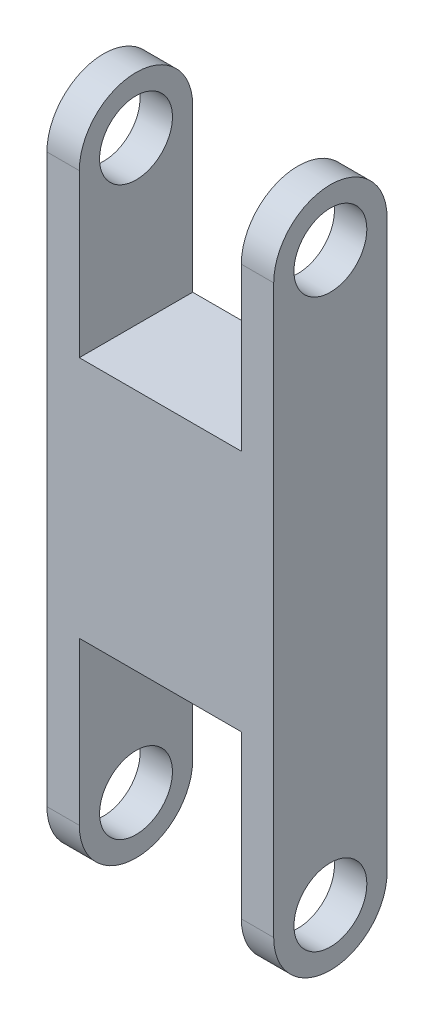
ISO-10303-21;
HEADER;
FILE_DESCRIPTION(('STEP AP214'),'2;1');
FILE_NAME('part.step','',(''),(''),'','','');
FILE_SCHEMA(('AUTOMOTIVE_DESIGN { 1 0 10303 214 1 1 1 1 }'));
ENDSEC;
DATA;
#1=APPLICATION_CONTEXT('core data for automotive mechanical design processes');
#2=APPLICATION_PROTOCOL_DEFINITION('international standard','automotive_design',2000,#1);
#3=PRODUCT_CONTEXT('',#1,'mechanical');
#4=PRODUCT('Part','Part','',(#3));
#5=PRODUCT_RELATED_PRODUCT_CATEGORY('part','',(#4));
#6=PRODUCT_DEFINITION_FORMATION('','',#4);
#7=PRODUCT_DEFINITION_CONTEXT('part definition',#1,'design');
#8=PRODUCT_DEFINITION('design','',#6,#7);
#9=PRODUCT_DEFINITION_SHAPE('','',#8);
#10=(LENGTH_UNIT() NAMED_UNIT(*) SI_UNIT(.MILLI.,.METRE.));
#11=(NAMED_UNIT(*) PLANE_ANGLE_UNIT() SI_UNIT($,.RADIAN.));
#12=(NAMED_UNIT(*) SI_UNIT($,.STERADIAN.) SOLID_ANGLE_UNIT());
#13=UNCERTAINTY_MEASURE_WITH_UNIT(LENGTH_MEASURE(1.E-05),#10,'distance_accuracy_value','');
#14=(GEOMETRIC_REPRESENTATION_CONTEXT(3) GLOBAL_UNCERTAINTY_ASSIGNED_CONTEXT((#13)) GLOBAL_UNIT_ASSIGNED_CONTEXT((#10,
#11,#12)) REPRESENTATION_CONTEXT('',''));
#15=CARTESIAN_POINT('',(0.,0.,0.));
#16=DIRECTION('',(0.,0.,1.));
#17=DIRECTION('',(1.,0.,0.));
#18=AXIS2_PLACEMENT_3D('',#15,#16,#17);
#19=CARTESIAN_POINT('',(0.,-175.,-35.));
#20=DIRECTION('',(1.,0.,0.));
#21=DIRECTION('',(0.,0.,-1.));
#22=AXIS2_PLACEMENT_3D('',#19,#20,#21);
#23=PLANE('',#22);
#24=CARTESIAN_POINT('',(0.,175.,-35.));
#25=DIRECTION('',(1.,0.,0.));
#26=DIRECTION('',(0.,0.,-1.));
#27=AXIS2_PLACEMENT_3D('',#24,#25,#26);
#28=CIRCLE('',#27,22.5);
#29=CARTESIAN_POINT('',(0.,175.,-57.5));
#30=VERTEX_POINT('',#29);
#31=EDGE_CURVE('E202',#30,#30,#28,.T.);
#32=ORIENTED_EDGE('',*,*,#31,.T.);
#33=EDGE_LOOP('',(#32));
#34=FACE_BOUND('',#33,.T.);
#35=DIRECTION('',(0.,0.,-1.));
#36=VECTOR('',#35,1.);
#37=CARTESIAN_POINT('',(0.,75.,-70.));
#38=LINE('',#37,#36);
#39=CARTESIAN_POINT('',(0.,75.,0.));
#40=VERTEX_POINT('',#39);
#41=CARTESIAN_POINT('',(0.,75.,-70.));
#42=VERTEX_POINT('',#41);
#43=EDGE_CURVE('E178',#40,#42,#38,.T.);
#44=ORIENTED_EDGE('',*,*,#43,.F.);
#45=DIRECTION('',(0.,-1.,0.));
#46=VECTOR('',#45,1.);
#47=CARTESIAN_POINT('',(0.,175.,0.));
#48=LINE('',#47,#46);
#49=CARTESIAN_POINT('',(0.,175.,0.));
#50=VERTEX_POINT('',#49);
#51=EDGE_CURVE('E219',#50,#40,#48,.T.);
#52=ORIENTED_EDGE('',*,*,#51,.F.);
#53=CARTESIAN_POINT('',(0.,175.,-35.));
#54=DIRECTION('',(1.,0.,0.));
#55=DIRECTION('',(0.,0.,-1.));
#56=AXIS2_PLACEMENT_3D('',#53,#54,#55);
#57=CIRCLE('',#56,35.);
#58=CARTESIAN_POINT('',(0.,175.,-70.));
#59=VERTEX_POINT('',#58);
#60=EDGE_CURVE('E235',#59,#50,#57,.T.);
#61=ORIENTED_EDGE('',*,*,#60,.F.);
#62=DIRECTION('',(0.,1.,0.));
#63=VECTOR('',#62,1.);
#64=CARTESIAN_POINT('',(0.,-175.,-70.));
#65=LINE('',#64,#63);
#66=EDGE_CURVE('E57',#42,#59,#65,.T.);
#67=ORIENTED_EDGE('',*,*,#66,.F.);
#68=EDGE_LOOP('',(#44,#52,#61,#67));
#69=FACE_BOUND('',#68,.T.);
#70=ADVANCED_FACE('F41',(#34,#69),#23,.F.);
#71=CARTESIAN_POINT('',(0.,-175.,-35.));
#72=DIRECTION('',(1.,0.,0.));
#73=DIRECTION('',(0.,0.,-1.));
#74=AXIS2_PLACEMENT_3D('',#71,#72,#73);
#75=CIRCLE('',#74,22.5);
#76=CARTESIAN_POINT('',(0.,-175.,-57.5));
#77=VERTEX_POINT('',#76);
#78=EDGE_CURVE('E197',#77,#77,#75,.T.);
#79=ORIENTED_EDGE('',*,*,#78,.T.);
#80=EDGE_LOOP('',(#79));
#81=FACE_BOUND('',#80,.T.);
#82=DIRECTION('',(0.,0.,1.));
#83=VECTOR('',#82,1.);
#84=CARTESIAN_POINT('',(0.,-75.,-70.));
#85=LINE('',#84,#83);
#86=CARTESIAN_POINT('',(0.,-75.,-70.));
#87=VERTEX_POINT('',#86);
#88=CARTESIAN_POINT('',(0.,-75.,0.));
#89=VERTEX_POINT('',#88);
#90=EDGE_CURVE('E65',#87,#89,#85,.T.);
#91=ORIENTED_EDGE('',*,*,#90,.F.);
#92=CARTESIAN_POINT('',(0.,-175.,-70.));
#93=VERTEX_POINT('',#92);
#94=EDGE_CURVE('E232',#93,#87,#65,.T.);
#95=ORIENTED_EDGE('',*,*,#94,.F.);
#96=CARTESIAN_POINT('',(0.,-175.,-35.));
#97=DIRECTION('',(1.,0.,0.));
#98=DIRECTION('',(0.,0.,-1.));
#99=AXIS2_PLACEMENT_3D('',#96,#97,#98);
#100=CIRCLE('',#99,35.);
#101=CARTESIAN_POINT('',(0.,-175.,0.));
#102=VERTEX_POINT('',#101);
#103=EDGE_CURVE('E210',#102,#93,#100,.T.);
#104=ORIENTED_EDGE('',*,*,#103,.F.);
#105=EDGE_CURVE('E238',#89,#102,#48,.T.);
#106=ORIENTED_EDGE('',*,*,#105,.F.);
#107=EDGE_LOOP('',(#91,#95,#104,#106));
#108=FACE_BOUND('',#107,.T.);
#109=ADVANCED_FACE('F326',(#81,#108),#23,.F.);
#110=CARTESIAN_POINT('',(20.,-175.,-35.));
#111=DIRECTION('',(1.,0.,0.));
#112=DIRECTION('',(0.,0.,-1.));
#113=AXIS2_PLACEMENT_3D('',#110,#111,#112);
#114=PLANE('',#113);
#115=CARTESIAN_POINT('',(20.,175.,-35.));
#116=DIRECTION('',(1.,0.,0.));
#117=DIRECTION('',(0.,0.,-1.));
#118=AXIS2_PLACEMENT_3D('',#115,#116,#117);
#119=CIRCLE('',#118,22.5);
#120=CARTESIAN_POINT('',(20.,175.,-57.5));
#121=VERTEX_POINT('',#120);
#122=EDGE_CURVE('E206',#121,#121,#119,.T.);
#123=ORIENTED_EDGE('',*,*,#122,.F.);
#124=EDGE_LOOP('',(#123));
#125=FACE_BOUND('',#124,.T.);
#126=CARTESIAN_POINT('',(20.,-175.,-35.));
#127=DIRECTION('',(1.,0.,0.));
#128=DIRECTION('',(0.,0.,-1.));
#129=AXIS2_PLACEMENT_3D('',#126,#127,#128);
#130=CIRCLE('',#129,35.);
#131=CARTESIAN_POINT('',(20.,-175.,0.));
#132=VERTEX_POINT('',#131);
#133=CARTESIAN_POINT('',(20.,-175.,-70.));
#134=VERTEX_POINT('',#133);
#135=EDGE_CURVE('E214',#132,#134,#130,.T.);
#136=ORIENTED_EDGE('',*,*,#135,.T.);
#137=DIRECTION('',(0.,1.,0.));
#138=VECTOR('',#137,1.);
#139=CARTESIAN_POINT('',(20.,-175.,-70.));
#140=LINE('',#139,#138);
#141=CARTESIAN_POINT('',(20.,175.,-70.));
#142=VERTEX_POINT('',#141);
#143=EDGE_CURVE('E218',#134,#142,#140,.T.);
#144=ORIENTED_EDGE('',*,*,#143,.T.);
#145=CARTESIAN_POINT('',(20.,175.,-35.));
#146=DIRECTION('',(1.,0.,0.));
#147=DIRECTION('',(0.,0.,-1.));
#148=AXIS2_PLACEMENT_3D('',#145,#146,#147);
#149=CIRCLE('',#148,35.);
#150=CARTESIAN_POINT('',(20.,175.,0.));
#151=VERTEX_POINT('',#150);
#152=EDGE_CURVE('E222',#142,#151,#149,.T.);
#153=ORIENTED_EDGE('',*,*,#152,.T.);
#154=DIRECTION('',(0.,-1.,0.));
#155=VECTOR('',#154,1.);
#156=CARTESIAN_POINT('',(20.,175.,0.));
#157=LINE('',#156,#155);
#158=EDGE_CURVE('E225',#151,#132,#157,.T.);
#159=ORIENTED_EDGE('',*,*,#158,.T.);
#160=EDGE_LOOP('',(#136,#144,#153,#159));
#161=FACE_BOUND('',#160,.T.);
#162=CARTESIAN_POINT('',(20.,-175.,-35.));
#163=DIRECTION('',(1.,0.,0.));
#164=DIRECTION('',(0.,0.,-1.));
#165=AXIS2_PLACEMENT_3D('',#162,#163,#164);
#166=CIRCLE('',#165,22.5);
#167=CARTESIAN_POINT('',(20.,-175.,-57.5));
#168=VERTEX_POINT('',#167);
#169=EDGE_CURVE('E198',#168,#168,#166,.T.);
#170=ORIENTED_EDGE('',*,*,#169,.F.);
#171=EDGE_LOOP('',(#170));
#172=FACE_BOUND('',#171,.T.);
#173=ADVANCED_FACE('F332',(#125,#161,#172),#114,.T.);
#174=CARTESIAN_POINT('',(20.,-175.,-35.));
#175=DIRECTION('',(-1.,0.,0.));
#176=DIRECTION('',(0.,0.,1.));
#177=AXIS2_PLACEMENT_3D('',#174,#175,#176);
#178=CYLINDRICAL_SURFACE('',#177,35.);
#179=ORIENTED_EDGE('',*,*,#103,.T.);
#180=DIRECTION('',(-1.,0.,0.));
#181=VECTOR('',#180,1.);
#182=CARTESIAN_POINT('',(20.,-175.,-70.));
#183=LINE('',#182,#181);
#184=EDGE_CURVE('E11',#134,#93,#183,.T.);
#185=ORIENTED_EDGE('',*,*,#184,.F.);
#186=ORIENTED_EDGE('',*,*,#135,.F.);
#187=DIRECTION('',(-1.,0.,0.));
#188=VECTOR('',#187,1.);
#189=CARTESIAN_POINT('',(20.,-175.,0.));
#190=LINE('',#189,#188);
#191=EDGE_CURVE('E228',#132,#102,#190,.T.);
#192=ORIENTED_EDGE('',*,*,#191,.T.);
#193=EDGE_LOOP('',(#179,#185,#186,#192));
#194=FACE_BOUND('',#193,.T.);
#195=ADVANCED_FACE('F43',(#194),#178,.T.);
#196=CARTESIAN_POINT('',(20.,-175.,-70.));
#197=DIRECTION('',(0.,0.,1.));
#198=DIRECTION('',(1.,0.,0.));
#199=AXIS2_PLACEMENT_3D('',#196,#197,#198);
#200=PLANE('',#199);
#201=ORIENTED_EDGE('',*,*,#94,.T.);
#202=DIRECTION('',(1.,0.,0.));
#203=VECTOR('',#202,1.);
#204=CARTESIAN_POINT('',(-215.529453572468,-75.,-70.));
#205=LINE('',#204,#203);
#206=CARTESIAN_POINT('',(-100.,-75.,-70.));
#207=VERTEX_POINT('',#206);
#208=EDGE_CURVE('E193',#207,#87,#205,.T.);
#209=ORIENTED_EDGE('',*,*,#208,.F.);
#210=DIRECTION('',(0.,-1.,0.));
#211=VECTOR('',#210,1.);
#212=CARTESIAN_POINT('',(-100.,-175.,-70.));
#213=LINE('',#212,#211);
#214=CARTESIAN_POINT('',(-100.,-175.,-70.));
#215=VERTEX_POINT('',#214);
#216=EDGE_CURVE('E279',#207,#215,#213,.T.);
#217=ORIENTED_EDGE('',*,*,#216,.T.);
#218=DIRECTION('',(1.,0.,0.));
#219=VECTOR('',#218,1.);
#220=CARTESIAN_POINT('',(-120.,-175.,-70.));
#221=LINE('',#220,#219);
#222=CARTESIAN_POINT('',(-120.,-175.,-70.));
#223=VERTEX_POINT('',#222);
#224=EDGE_CURVE('E282',#223,#215,#221,.T.);
#225=ORIENTED_EDGE('',*,*,#224,.F.);
#226=DIRECTION('',(0.,-1.,0.));
#227=VECTOR('',#226,1.);
#228=CARTESIAN_POINT('',(-120.,-175.,-70.));
#229=LINE('',#228,#227);
#230=CARTESIAN_POINT('',(-120.,175.,-70.));
#231=VERTEX_POINT('',#230);
#232=EDGE_CURVE('E151',#231,#223,#229,.T.);
#233=ORIENTED_EDGE('',*,*,#232,.F.);
#234=DIRECTION('',(1.,0.,0.));
#235=VECTOR('',#234,1.);
#236=CARTESIAN_POINT('',(-120.,175.,-70.));
#237=LINE('',#236,#235);
#238=CARTESIAN_POINT('',(-100.,175.,-70.));
#239=VERTEX_POINT('',#238);
#240=EDGE_CURVE('E169',#231,#239,#237,.T.);
#241=ORIENTED_EDGE('',*,*,#240,.T.);
#242=CARTESIAN_POINT('',(-100.,75.,-70.));
#243=VERTEX_POINT('',#242);
#244=EDGE_CURVE('E156',#239,#243,#213,.T.);
#245=ORIENTED_EDGE('',*,*,#244,.T.);
#246=DIRECTION('',(1.,0.,0.));
#247=VECTOR('',#246,1.);
#248=CARTESIAN_POINT('',(-215.529453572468,75.,-70.));
#249=LINE('',#248,#247);
#250=EDGE_CURVE('E182',#243,#42,#249,.T.);
#251=ORIENTED_EDGE('',*,*,#250,.T.);
#252=ORIENTED_EDGE('',*,*,#66,.T.);
#253=DIRECTION('',(-1.,0.,0.));
#254=VECTOR('',#253,1.);
#255=CARTESIAN_POINT('',(20.,175.,-70.));
#256=LINE('',#255,#254);
#257=EDGE_CURVE('E50',#142,#59,#256,.T.);
#258=ORIENTED_EDGE('',*,*,#257,.F.);
#259=ORIENTED_EDGE('',*,*,#143,.F.);
#260=ORIENTED_EDGE('',*,*,#184,.T.);
#261=EDGE_LOOP('',(#201,#209,#217,#225,#233,#241,#245,#251,#252,#258,#259,#260));
#262=FACE_BOUND('',#261,.T.);
#263=ADVANCED_FACE('F287',(#262),#200,.F.);
#264=CARTESIAN_POINT('',(20.,175.,-35.));
#265=DIRECTION('',(-1.,0.,0.));
#266=DIRECTION('',(0.,0.,1.));
#267=AXIS2_PLACEMENT_3D('',#264,#265,#266);
#268=CYLINDRICAL_SURFACE('',#267,35.);
#269=ORIENTED_EDGE('',*,*,#60,.T.);
#270=DIRECTION('',(-1.,0.,0.));
#271=VECTOR('',#270,1.);
#272=CARTESIAN_POINT('',(20.,175.,0.));
#273=LINE('',#272,#271);
#274=EDGE_CURVE('E244',#151,#50,#273,.T.);
#275=ORIENTED_EDGE('',*,*,#274,.F.);
#276=ORIENTED_EDGE('',*,*,#152,.F.);
#277=ORIENTED_EDGE('',*,*,#257,.T.);
#278=EDGE_LOOP('',(#269,#275,#276,#277));
#279=FACE_BOUND('',#278,.T.);
#280=ADVANCED_FACE('F252',(#279),#268,.T.);
#281=CARTESIAN_POINT('',(20.,175.,0.));
#282=DIRECTION('',(0.,0.,-1.));
#283=DIRECTION('',(0.,1.,0.));
#284=AXIS2_PLACEMENT_3D('',#281,#282,#283);
#285=PLANE('',#284);
#286=ORIENTED_EDGE('',*,*,#51,.T.);
#287=DIRECTION('',(1.,0.,0.));
#288=VECTOR('',#287,1.);
#289=CARTESIAN_POINT('',(-215.529453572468,75.,0.));
#290=LINE('',#289,#288);
#291=CARTESIAN_POINT('',(-100.,75.,0.));
#292=VERTEX_POINT('',#291);
#293=EDGE_CURVE('E185',#292,#40,#290,.T.);
#294=ORIENTED_EDGE('',*,*,#293,.F.);
#295=DIRECTION('',(0.,1.,0.));
#296=VECTOR('',#295,1.);
#297=CARTESIAN_POINT('',(-100.,175.,0.));
#298=LINE('',#297,#296);
#299=CARTESIAN_POINT('',(-100.,175.,0.));
#300=VERTEX_POINT('',#299);
#301=EDGE_CURVE('E265',#292,#300,#298,.T.);
#302=ORIENTED_EDGE('',*,*,#301,.T.);
#303=DIRECTION('',(1.,0.,0.));
#304=VECTOR('',#303,1.);
#305=CARTESIAN_POINT('',(-120.,175.,0.));
#306=LINE('',#305,#304);
#307=CARTESIAN_POINT('',(-120.,175.,0.));
#308=VERTEX_POINT('',#307);
#309=EDGE_CURVE('E140',#308,#300,#306,.T.);
#310=ORIENTED_EDGE('',*,*,#309,.F.);
#311=DIRECTION('',(0.,1.,0.));
#312=VECTOR('',#311,1.);
#313=CARTESIAN_POINT('',(-120.,175.,0.));
#314=LINE('',#313,#312);
#315=CARTESIAN_POINT('',(-120.,-175.,0.));
#316=VERTEX_POINT('',#315);
#317=EDGE_CURVE('E131',#316,#308,#314,.T.);
#318=ORIENTED_EDGE('',*,*,#317,.F.);
#319=DIRECTION('',(1.,0.,0.));
#320=VECTOR('',#319,1.);
#321=CARTESIAN_POINT('',(-120.,-175.,0.));
#322=LINE('',#321,#320);
#323=CARTESIAN_POINT('',(-100.,-175.,0.));
#324=VERTEX_POINT('',#323);
#325=EDGE_CURVE('E137',#316,#324,#322,.T.);
#326=ORIENTED_EDGE('',*,*,#325,.T.);
#327=CARTESIAN_POINT('',(-100.,-75.,0.));
#328=VERTEX_POINT('',#327);
#329=EDGE_CURVE('E269',#324,#328,#298,.T.);
#330=ORIENTED_EDGE('',*,*,#329,.T.);
#331=DIRECTION('',(1.,0.,0.));
#332=VECTOR('',#331,1.);
#333=CARTESIAN_POINT('',(-215.529453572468,-75.,0.));
#334=LINE('',#333,#332);
#335=EDGE_CURVE('E189',#328,#89,#334,.T.);
#336=ORIENTED_EDGE('',*,*,#335,.T.);
#337=ORIENTED_EDGE('',*,*,#105,.T.);
#338=ORIENTED_EDGE('',*,*,#191,.F.);
#339=ORIENTED_EDGE('',*,*,#158,.F.);
#340=ORIENTED_EDGE('',*,*,#274,.T.);
#341=EDGE_LOOP('',(#286,#294,#302,#310,#318,#326,#330,#336,#337,#338,#339,#340));
#342=FACE_BOUND('',#341,.T.);
#343=ADVANCED_FACE('F134',(#342),#285,.F.);
#344=CARTESIAN_POINT('',(20.,175.,-35.));
#345=DIRECTION('',(-1.,0.,0.));
#346=DIRECTION('',(0.,0.,1.));
#347=AXIS2_PLACEMENT_3D('',#344,#345,#346);
#348=CYLINDRICAL_SURFACE('',#347,22.5);
#349=ORIENTED_EDGE('',*,*,#122,.T.);
#350=EDGE_LOOP('',(#349));
#351=FACE_BOUND('',#350,.T.);
#352=ORIENTED_EDGE('',*,*,#31,.F.);
#353=EDGE_LOOP('',(#352));
#354=FACE_BOUND('',#353,.T.);
#355=ADVANCED_FACE('F339',(#351,#354),#348,.F.);
#356=CARTESIAN_POINT('',(20.,-175.,-35.));
#357=DIRECTION('',(-1.,0.,0.));
#358=DIRECTION('',(0.,0.,1.));
#359=AXIS2_PLACEMENT_3D('',#356,#357,#358);
#360=CYLINDRICAL_SURFACE('',#359,22.5);
#361=ORIENTED_EDGE('',*,*,#169,.T.);
#362=EDGE_LOOP('',(#361));
#363=FACE_BOUND('',#362,.T.);
#364=ORIENTED_EDGE('',*,*,#78,.F.);
#365=EDGE_LOOP('',(#364));
#366=FACE_BOUND('',#365,.T.);
#367=ADVANCED_FACE('F368',(#363,#366),#360,.F.);
#368=CARTESIAN_POINT('',(-215.529453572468,75.,-70.));
#369=DIRECTION('',(0.,-1.,0.));
#370=DIRECTION('',(0.,0.,-1.));
#371=AXIS2_PLACEMENT_3D('',#368,#369,#370);
#372=PLANE('',#371);
#373=ORIENTED_EDGE('',*,*,#250,.F.);
#374=DIRECTION('',(0.,0.,-1.));
#375=VECTOR('',#374,1.);
#376=CARTESIAN_POINT('',(-100.,75.,-70.));
#377=LINE('',#376,#375);
#378=EDGE_CURVE('E167',#292,#243,#377,.T.);
#379=ORIENTED_EDGE('',*,*,#378,.F.);
#380=ORIENTED_EDGE('',*,*,#293,.T.);
#381=ORIENTED_EDGE('',*,*,#43,.T.);
#382=EDGE_LOOP('',(#373,#379,#380,#381));
#383=FACE_BOUND('',#382,.T.);
#384=ADVANCED_FACE('F259',(#383),#372,.F.);
#385=CARTESIAN_POINT('',(-215.529453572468,-75.,-70.));
#386=DIRECTION('',(0.,1.,0.));
#387=DIRECTION('',(0.,0.,1.));
#388=AXIS2_PLACEMENT_3D('',#385,#386,#387);
#389=PLANE('',#388);
#390=ORIENTED_EDGE('',*,*,#335,.F.);
#391=DIRECTION('',(0.,0.,1.));
#392=VECTOR('',#391,1.);
#393=CARTESIAN_POINT('',(-100.,-75.,-70.));
#394=LINE('',#393,#392);
#395=EDGE_CURVE('E162',#207,#328,#394,.T.);
#396=ORIENTED_EDGE('',*,*,#395,.F.);
#397=ORIENTED_EDGE('',*,*,#208,.T.);
#398=ORIENTED_EDGE('',*,*,#90,.T.);
#399=EDGE_LOOP('',(#390,#396,#397,#398));
#400=FACE_BOUND('',#399,.T.);
#401=ADVANCED_FACE('F322',(#400),#389,.F.);
#402=CARTESIAN_POINT('',(-100.,-175.,-35.));
#403=DIRECTION('',(1.,0.,0.));
#404=DIRECTION('',(0.,0.,-1.));
#405=AXIS2_PLACEMENT_3D('',#402,#403,#404);
#406=PLANE('',#405);
#407=CARTESIAN_POINT('',(-100.,-175.,-35.));
#408=DIRECTION('',(-1.,0.,0.));
#409=DIRECTION('',(0.,0.,1.));
#410=AXIS2_PLACEMENT_3D('',#407,#408,#409);
#411=CIRCLE('',#410,22.5);
#412=CARTESIAN_POINT('',(-100.,-175.,-12.5));
#413=VERTEX_POINT('',#412);
#414=EDGE_CURVE('E302',#413,#413,#411,.T.);
#415=ORIENTED_EDGE('',*,*,#414,.T.);
#416=EDGE_LOOP('',(#415));
#417=FACE_BOUND('',#416,.T.);
#418=ORIENTED_EDGE('',*,*,#216,.F.);
#419=ORIENTED_EDGE('',*,*,#395,.T.);
#420=ORIENTED_EDGE('',*,*,#329,.F.);
#421=CARTESIAN_POINT('',(-100.,-175.,-35.));
#422=DIRECTION('',(-1.,0.,0.));
#423=DIRECTION('',(0.,0.,-1.));
#424=AXIS2_PLACEMENT_3D('',#421,#422,#423);
#425=CIRCLE('',#424,35.);
#426=EDGE_CURVE('E160',#215,#324,#425,.T.);
#427=ORIENTED_EDGE('',*,*,#426,.F.);
#428=EDGE_LOOP('',(#418,#419,#420,#427));
#429=FACE_BOUND('',#428,.T.);
#430=ADVANCED_FACE('F314',(#417,#429),#406,.T.);
#431=CARTESIAN_POINT('',(-120.,-175.,-35.));
#432=DIRECTION('',(1.,0.,0.));
#433=DIRECTION('',(0.,0.,-1.));
#434=AXIS2_PLACEMENT_3D('',#431,#432,#433);
#435=PLANE('',#434);
#436=CARTESIAN_POINT('',(-120.,-175.,-35.));
#437=DIRECTION('',(-1.,0.,0.));
#438=DIRECTION('',(0.,0.,-1.));
#439=AXIS2_PLACEMENT_3D('',#436,#437,#438);
#440=CIRCLE('',#439,35.);
#441=EDGE_CURVE('E145',#223,#316,#440,.T.);
#442=ORIENTED_EDGE('',*,*,#441,.T.);
#443=ORIENTED_EDGE('',*,*,#317,.T.);
#444=CARTESIAN_POINT('',(-120.,175.,-35.));
#445=DIRECTION('',(-1.,0.,0.));
#446=DIRECTION('',(0.,0.,-1.));
#447=AXIS2_PLACEMENT_3D('',#444,#445,#446);
#448=CIRCLE('',#447,35.);
#449=EDGE_CURVE('E144',#308,#231,#448,.T.);
#450=ORIENTED_EDGE('',*,*,#449,.T.);
#451=ORIENTED_EDGE('',*,*,#232,.T.);
#452=EDGE_LOOP('',(#442,#443,#450,#451));
#453=FACE_BOUND('',#452,.T.);
#454=CARTESIAN_POINT('',(-120.,175.,-35.));
#455=DIRECTION('',(-1.,0.,0.));
#456=DIRECTION('',(0.,0.,1.));
#457=AXIS2_PLACEMENT_3D('',#454,#455,#456);
#458=CIRCLE('',#457,22.5);
#459=CARTESIAN_POINT('',(-120.,175.,-12.5));
#460=VERTEX_POINT('',#459);
#461=EDGE_CURVE('E273',#460,#460,#458,.T.);
#462=ORIENTED_EDGE('',*,*,#461,.F.);
#463=EDGE_LOOP('',(#462));
#464=FACE_BOUND('',#463,.T.);
#465=CARTESIAN_POINT('',(-120.,-175.,-35.));
#466=DIRECTION('',(-1.,0.,0.));
#467=DIRECTION('',(0.,0.,1.));
#468=AXIS2_PLACEMENT_3D('',#465,#466,#467);
#469=CIRCLE('',#468,22.5);
#470=CARTESIAN_POINT('',(-120.,-175.,-12.5));
#471=VERTEX_POINT('',#470);
#472=EDGE_CURVE('E298',#471,#471,#469,.T.);
#473=ORIENTED_EDGE('',*,*,#472,.F.);
#474=EDGE_LOOP('',(#473));
#475=FACE_BOUND('',#474,.T.);
#476=ADVANCED_FACE('F148',(#453,#464,#475),#435,.F.);
#477=CARTESIAN_POINT('',(-100.,175.,-35.));
#478=DIRECTION('',(-1.,0.,0.));
#479=DIRECTION('',(0.,0.,1.));
#480=AXIS2_PLACEMENT_3D('',#477,#478,#479);
#481=CIRCLE('',#480,22.5);
#482=CARTESIAN_POINT('',(-100.,175.,-12.5));
#483=VERTEX_POINT('',#482);
#484=EDGE_CURVE('E294',#483,#483,#481,.T.);
#485=ORIENTED_EDGE('',*,*,#484,.T.);
#486=EDGE_LOOP('',(#485));
#487=FACE_BOUND('',#486,.T.);
#488=ORIENTED_EDGE('',*,*,#301,.F.);
#489=ORIENTED_EDGE('',*,*,#378,.T.);
#490=ORIENTED_EDGE('',*,*,#244,.F.);
#491=CARTESIAN_POINT('',(-100.,175.,-35.));
#492=DIRECTION('',(-1.,0.,0.));
#493=DIRECTION('',(0.,0.,-1.));
#494=AXIS2_PLACEMENT_3D('',#491,#492,#493);
#495=CIRCLE('',#494,35.);
#496=EDGE_CURVE('E267',#300,#239,#495,.T.);
#497=ORIENTED_EDGE('',*,*,#496,.F.);
#498=EDGE_LOOP('',(#488,#489,#490,#497));
#499=FACE_BOUND('',#498,.T.);
#500=ADVANCED_FACE('F266',(#487,#499),#406,.T.);
#501=CARTESIAN_POINT('',(-120.,-175.,-35.));
#502=DIRECTION('',(1.,0.,0.));
#503=DIRECTION('',(0.,0.,-1.));
#504=AXIS2_PLACEMENT_3D('',#501,#502,#503);
#505=CYLINDRICAL_SURFACE('',#504,35.);
#506=ORIENTED_EDGE('',*,*,#426,.T.);
#507=ORIENTED_EDGE('',*,*,#325,.F.);
#508=ORIENTED_EDGE('',*,*,#441,.F.);
#509=ORIENTED_EDGE('',*,*,#224,.T.);
#510=EDGE_LOOP('',(#506,#507,#508,#509));
#511=FACE_BOUND('',#510,.T.);
#512=ADVANCED_FACE('F158',(#511),#505,.T.);
#513=CARTESIAN_POINT('',(-120.,175.,-35.));
#514=DIRECTION('',(1.,0.,0.));
#515=DIRECTION('',(0.,0.,-1.));
#516=AXIS2_PLACEMENT_3D('',#513,#514,#515);
#517=CYLINDRICAL_SURFACE('',#516,35.);
#518=ORIENTED_EDGE('',*,*,#496,.T.);
#519=ORIENTED_EDGE('',*,*,#240,.F.);
#520=ORIENTED_EDGE('',*,*,#449,.F.);
#521=ORIENTED_EDGE('',*,*,#309,.T.);
#522=EDGE_LOOP('',(#518,#519,#520,#521));
#523=FACE_BOUND('',#522,.T.);
#524=ADVANCED_FACE('F289',(#523),#517,.T.);
#525=CARTESIAN_POINT('',(-120.,175.,-35.));
#526=DIRECTION('',(1.,0.,0.));
#527=DIRECTION('',(0.,0.,-1.));
#528=AXIS2_PLACEMENT_3D('',#525,#526,#527);
#529=CYLINDRICAL_SURFACE('',#528,22.5);
#530=ORIENTED_EDGE('',*,*,#461,.T.);
#531=EDGE_LOOP('',(#530));
#532=FACE_BOUND('',#531,.T.);
#533=ORIENTED_EDGE('',*,*,#484,.F.);
#534=EDGE_LOOP('',(#533));
#535=FACE_BOUND('',#534,.T.);
#536=ADVANCED_FACE('F436',(#532,#535),#529,.F.);
#537=CARTESIAN_POINT('',(-120.,-175.,-35.));
#538=DIRECTION('',(1.,0.,0.));
#539=DIRECTION('',(0.,0.,-1.));
#540=AXIS2_PLACEMENT_3D('',#537,#538,#539);
#541=CYLINDRICAL_SURFACE('',#540,22.5);
#542=ORIENTED_EDGE('',*,*,#472,.T.);
#543=EDGE_LOOP('',(#542));
#544=FACE_BOUND('',#543,.T.);
#545=ORIENTED_EDGE('',*,*,#414,.F.);
#546=EDGE_LOOP('',(#545));
#547=FACE_BOUND('',#546,.T.);
#548=ADVANCED_FACE('F310',(#544,#547),#541,.F.);
#549=CLOSED_SHELL('',(#70,#109,#173,#195,#263,#280,#343,#355,#367,#384,#401,#430,#476,#500,#512,
#524,#536,#548));
#550=MANIFOLD_SOLID_BREP('B2',#549);
#551=ADVANCED_BREP_SHAPE_REPRESENTATION('',(#18,#550),#14);
#552=SHAPE_DEFINITION_REPRESENTATION(#9,#551);
ENDSEC;
END-ISO-10303-21;
